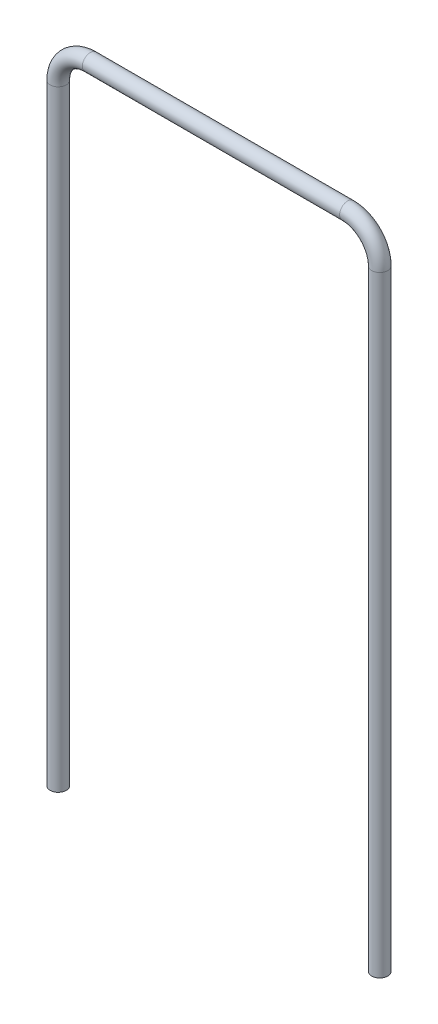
ISO-10303-21;
HEADER;
FILE_DESCRIPTION(('STEP AP214'),'2;1');
FILE_NAME('part.step','',(''),(''),'','','');
FILE_SCHEMA(('AUTOMOTIVE_DESIGN { 1 0 10303 214 1 1 1 1 }'));
ENDSEC;
DATA;
#1=APPLICATION_CONTEXT('core data for automotive mechanical design processes');
#2=APPLICATION_PROTOCOL_DEFINITION('international standard','automotive_design',2000,#1);
#3=PRODUCT_CONTEXT('',#1,'mechanical');
#4=PRODUCT('Part','Part','',(#3));
#5=PRODUCT_RELATED_PRODUCT_CATEGORY('part','',(#4));
#6=PRODUCT_DEFINITION_FORMATION('','',#4);
#7=PRODUCT_DEFINITION_CONTEXT('part definition',#1,'design');
#8=PRODUCT_DEFINITION('design','',#6,#7);
#9=PRODUCT_DEFINITION_SHAPE('','',#8);
#10=(LENGTH_UNIT() NAMED_UNIT(*) SI_UNIT(.MILLI.,.METRE.));
#11=(NAMED_UNIT(*) PLANE_ANGLE_UNIT() SI_UNIT($,.RADIAN.));
#12=(NAMED_UNIT(*) SI_UNIT($,.STERADIAN.) SOLID_ANGLE_UNIT());
#13=UNCERTAINTY_MEASURE_WITH_UNIT(LENGTH_MEASURE(1.E-05),#10,'distance_accuracy_value','');
#14=(GEOMETRIC_REPRESENTATION_CONTEXT(3) GLOBAL_UNCERTAINTY_ASSIGNED_CONTEXT((#13)) GLOBAL_UNIT_ASSIGNED_CONTEXT((#10,
#11,#12)) REPRESENTATION_CONTEXT('',''));
#15=CARTESIAN_POINT('',(0.,0.,0.));
#16=DIRECTION('',(0.,0.,1.));
#17=DIRECTION('',(1.,0.,0.));
#18=AXIS2_PLACEMENT_3D('',#15,#16,#17);
#19=CARTESIAN_POINT('',(50.,190.,0.));
#20=DIRECTION('',(0.,-1.,0.));
#21=DIRECTION('',(1.,0.,0.));
#22=AXIS2_PLACEMENT_3D('',#19,#20,#21);
#23=CYLINDRICAL_SURFACE('',#22,2.5);
#24=CARTESIAN_POINT('',(50.,190.,0.));
#25=DIRECTION('',(0.,-1.,0.));
#26=DIRECTION('',(0.,0.,1.));
#27=AXIS2_PLACEMENT_3D('',#24,#25,#26);
#28=CIRCLE('',#27,2.5);
#29=CARTESIAN_POINT('',(52.5,190.,0.));
#30=VERTEX_POINT('',#29);
#31=EDGE_CURVE('E36',#30,#30,#28,.T.);
#32=ORIENTED_EDGE('',*,*,#31,.T.);
#33=EDGE_LOOP('',(#32));
#34=FACE_BOUND('',#33,.T.);
#35=CARTESIAN_POINT('',(50.,0.,0.));
#36=DIRECTION('',(0.,-1.,0.));
#37=DIRECTION('',(0.,0.,1.));
#38=AXIS2_PLACEMENT_3D('',#35,#36,#37);
#39=CIRCLE('',#38,2.5);
#40=CARTESIAN_POINT('',(50.,0.,2.5));
#41=VERTEX_POINT('',#40);
#42=EDGE_CURVE('E10',#41,#41,#39,.T.);
#43=ORIENTED_EDGE('',*,*,#42,.F.);
#44=EDGE_LOOP('',(#43));
#45=FACE_BOUND('',#44,.T.);
#46=ADVANCED_FACE('F30',(#34,#45),#23,.T.);
#47=CARTESIAN_POINT('',(40.,190.,0.));
#48=DIRECTION('',(0.,0.,-1.));
#49=DIRECTION('',(-1.,0.,0.));
#50=AXIS2_PLACEMENT_3D('',#47,#48,#49);
#51=TOROIDAL_SURFACE('',#50,10.,2.5);
#52=CARTESIAN_POINT('',(40.,200.,0.));
#53=DIRECTION('',(1.,0.,0.));
#54=DIRECTION('',(0.,0.,1.));
#55=AXIS2_PLACEMENT_3D('',#52,#53,#54);
#56=CIRCLE('',#55,2.5);
#57=CARTESIAN_POINT('',(40.,202.5,0.));
#58=VERTEX_POINT('',#57);
#59=EDGE_CURVE('E40',#58,#58,#56,.T.);
#60=CARTESIAN_POINT('',(40.,190.,0.));
#61=DIRECTION('',(0.,0.,-1.));
#62=DIRECTION('',(-1.,0.,0.));
#63=AXIS2_PLACEMENT_3D('',#60,#61,#62);
#64=CIRCLE('',#63,12.5);
#65=EDGE_CURVE('',#58,#30,#64,.T.);
#66=ORIENTED_EDGE('',*,*,#59,.T.);
#67=ORIENTED_EDGE('',*,*,#31,.F.);
#68=ORIENTED_EDGE('',*,*,#65,.T.);
#69=ORIENTED_EDGE('',*,*,#65,.F.);
#70=EDGE_LOOP('',(#66,#68,#67,#69));
#71=FACE_BOUND('',#70,.T.);
#72=ADVANCED_FACE('F74',(#71),#51,.T.);
#73=CARTESIAN_POINT('',(-40.,200.,0.));
#74=DIRECTION('',(1.,0.,0.));
#75=DIRECTION('',(0.,0.,-1.));
#76=AXIS2_PLACEMENT_3D('',#73,#74,#75);
#77=CYLINDRICAL_SURFACE('',#76,2.5);
#78=CARTESIAN_POINT('',(-40.,200.,0.));
#79=DIRECTION('',(1.,0.,0.));
#80=DIRECTION('',(0.,0.,1.));
#81=AXIS2_PLACEMENT_3D('',#78,#79,#80);
#82=CIRCLE('',#81,2.5);
#83=CARTESIAN_POINT('',(-40.,202.5,0.));
#84=VERTEX_POINT('',#83);
#85=EDGE_CURVE('E44',#84,#84,#82,.T.);
#86=ORIENTED_EDGE('',*,*,#85,.T.);
#87=EDGE_LOOP('',(#86));
#88=FACE_BOUND('',#87,.T.);
#89=ORIENTED_EDGE('',*,*,#59,.F.);
#90=EDGE_LOOP('',(#89));
#91=FACE_BOUND('',#90,.T.);
#92=ADVANCED_FACE('F78',(#88,#91),#77,.T.);
#93=CARTESIAN_POINT('',(-40.,190.,0.));
#94=DIRECTION('',(0.,0.,-1.));
#95=DIRECTION('',(-1.,0.,0.));
#96=AXIS2_PLACEMENT_3D('',#93,#94,#95);
#97=TOROIDAL_SURFACE('',#96,10.,2.5);
#98=CARTESIAN_POINT('',(-50.,190.,0.));
#99=DIRECTION('',(0.,1.,0.));
#100=DIRECTION('',(0.,0.,1.));
#101=AXIS2_PLACEMENT_3D('',#98,#99,#100);
#102=CIRCLE('',#101,2.5);
#103=CARTESIAN_POINT('',(-52.5,190.,0.));
#104=VERTEX_POINT('',#103);
#105=EDGE_CURVE('E49',#104,#104,#102,.T.);
#106=CARTESIAN_POINT('',(-40.,190.,0.));
#107=DIRECTION('',(0.,0.,-1.));
#108=DIRECTION('',(-1.,0.,0.));
#109=AXIS2_PLACEMENT_3D('',#106,#107,#108);
#110=CIRCLE('',#109,12.5);
#111=EDGE_CURVE('',#104,#84,#110,.T.);
#112=ORIENTED_EDGE('',*,*,#105,.T.);
#113=ORIENTED_EDGE('',*,*,#85,.F.);
#114=ORIENTED_EDGE('',*,*,#111,.T.);
#115=ORIENTED_EDGE('',*,*,#111,.F.);
#116=EDGE_LOOP('',(#112,#114,#113,#115));
#117=FACE_BOUND('',#116,.T.);
#118=ADVANCED_FACE('F56',(#117),#97,.T.);
#119=CARTESIAN_POINT('',(-50.,190.,0.));
#120=DIRECTION('',(0.,-1.,0.));
#121=DIRECTION('',(1.,0.,0.));
#122=AXIS2_PLACEMENT_3D('',#119,#120,#121);
#123=CYLINDRICAL_SURFACE('',#122,2.5);
#124=ORIENTED_EDGE('',*,*,#105,.F.);
#125=EDGE_LOOP('',(#124));
#126=FACE_BOUND('',#125,.T.);
#127=CARTESIAN_POINT('',(-50.,0.,0.));
#128=DIRECTION('',(0.,1.,0.));
#129=DIRECTION('',(0.,0.,1.));
#130=AXIS2_PLACEMENT_3D('',#127,#128,#129);
#131=CIRCLE('',#130,2.5);
#132=CARTESIAN_POINT('',(-50.,0.,2.5));
#133=VERTEX_POINT('',#132);
#134=EDGE_CURVE('E50',#133,#133,#131,.T.);
#135=ORIENTED_EDGE('',*,*,#134,.T.);
#136=EDGE_LOOP('',(#135));
#137=FACE_BOUND('',#136,.T.);
#138=ADVANCED_FACE('F59',(#126,#137),#123,.T.);
#139=CARTESIAN_POINT('',(50.,0.,0.));
#140=DIRECTION('',(0.,-1.,0.));
#141=DIRECTION('',(0.,0.,1.));
#142=AXIS2_PLACEMENT_3D('',#139,#140,#141);
#143=PLANE('',#142);
#144=ORIENTED_EDGE('',*,*,#42,.T.);
#145=EDGE_LOOP('',(#144));
#146=FACE_BOUND('',#145,.T.);
#147=ADVANCED_FACE('F62',(#146),#143,.T.);
#148=CARTESIAN_POINT('',(-50.,0.,0.));
#149=DIRECTION('',(0.,1.,0.));
#150=DIRECTION('',(0.,0.,1.));
#151=AXIS2_PLACEMENT_3D('',#148,#149,#150);
#152=PLANE('',#151);
#153=ORIENTED_EDGE('',*,*,#134,.F.);
#154=EDGE_LOOP('',(#153));
#155=FACE_BOUND('',#154,.T.);
#156=ADVANCED_FACE('F66',(#155),#152,.F.);
#157=CLOSED_SHELL('',(#46,#72,#92,#118,#138,#147,#156));
#158=MANIFOLD_SOLID_BREP('B2',#157);
#159=ADVANCED_BREP_SHAPE_REPRESENTATION('',(#18,#158),#14);
#160=SHAPE_DEFINITION_REPRESENTATION(#9,#159);
ENDSEC;
END-ISO-10303-21;
